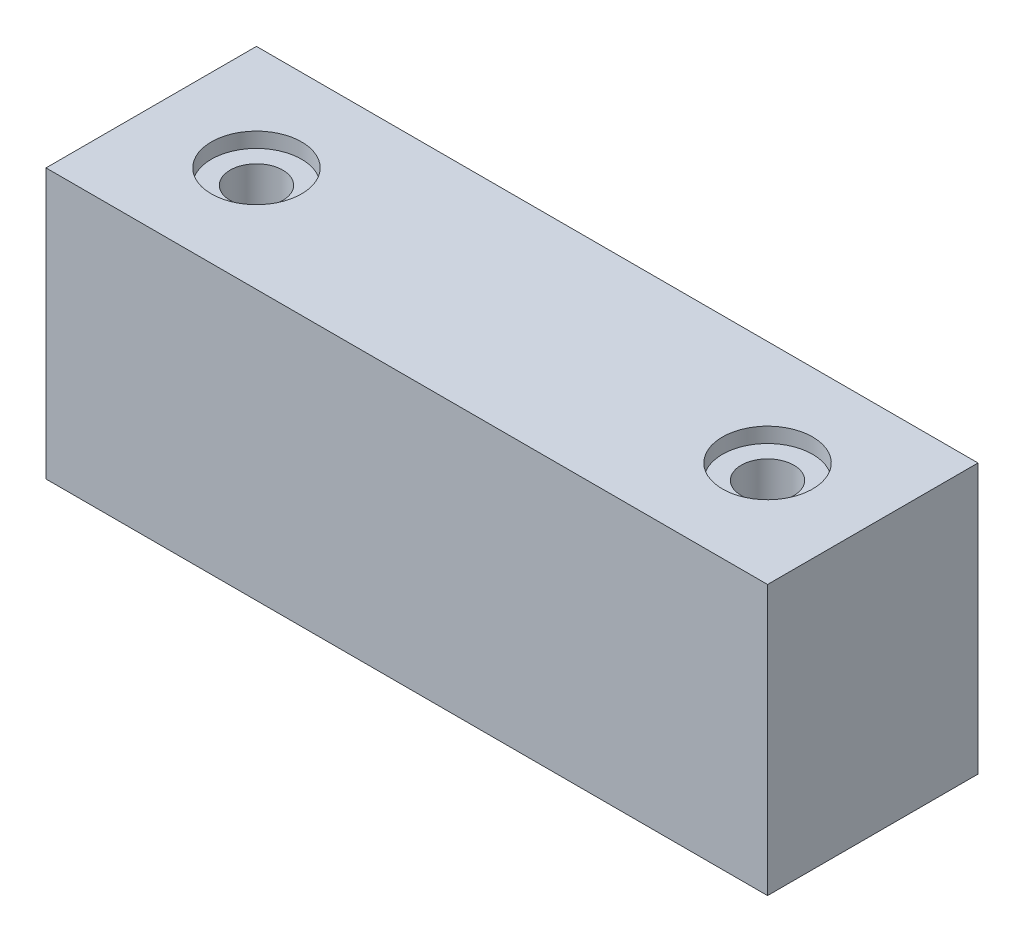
ISO-10303-21;
HEADER;
FILE_DESCRIPTION(('STEP AP214'),'2;1');
FILE_NAME('part.step','',(''),(''),'','','');
FILE_SCHEMA(('AUTOMOTIVE_DESIGN { 1 0 10303 214 1 1 1 1 }'));
ENDSEC;
DATA;
#1=APPLICATION_CONTEXT('core data for automotive mechanical design processes');
#2=APPLICATION_PROTOCOL_DEFINITION('international standard','automotive_design',2000,#1);
#3=PRODUCT_CONTEXT('',#1,'mechanical');
#4=PRODUCT('Part','Part','',(#3));
#5=PRODUCT_RELATED_PRODUCT_CATEGORY('part','',(#4));
#6=PRODUCT_DEFINITION_FORMATION('','',#4);
#7=PRODUCT_DEFINITION_CONTEXT('part definition',#1,'design');
#8=PRODUCT_DEFINITION('design','',#6,#7);
#9=PRODUCT_DEFINITION_SHAPE('','',#8);
#10=(LENGTH_UNIT() NAMED_UNIT(*) SI_UNIT(.MILLI.,.METRE.));
#11=(NAMED_UNIT(*) PLANE_ANGLE_UNIT() SI_UNIT($,.RADIAN.));
#12=(NAMED_UNIT(*) SI_UNIT($,.STERADIAN.) SOLID_ANGLE_UNIT());
#13=UNCERTAINTY_MEASURE_WITH_UNIT(LENGTH_MEASURE(1.E-05),#10,'distance_accuracy_value','');
#14=(GEOMETRIC_REPRESENTATION_CONTEXT(3) GLOBAL_UNCERTAINTY_ASSIGNED_CONTEXT((#13)) GLOBAL_UNIT_ASSIGNED_CONTEXT((#10,
#11,#12)) REPRESENTATION_CONTEXT('',''));
#15=CARTESIAN_POINT('',(0.,0.,0.));
#16=DIRECTION('',(0.,0.,1.));
#17=DIRECTION('',(1.,0.,0.));
#18=AXIS2_PLACEMENT_3D('',#15,#16,#17);
#19=CARTESIAN_POINT('',(-128.226206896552,-133.481379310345,88.9));
#20=DIRECTION('',(0.,1.,0.));
#21=DIRECTION('',(0.,0.,1.));
#22=AXIS2_PLACEMENT_3D('',#19,#20,#21);
#23=PLANE('',#22);
#24=CARTESIAN_POINT('',(-83.776206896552,-133.481379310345,44.45));
#25=DIRECTION('',(0.,1.,0.));
#26=DIRECTION('',(0.,0.,1.));
#27=AXIS2_PLACEMENT_3D('',#24,#25,#26);
#28=CIRCLE('',#27,11.1125);
#29=CARTESIAN_POINT('',(-83.776206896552,-133.481379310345,55.5625));
#30=VERTEX_POINT('',#29);
#31=EDGE_CURVE('E142',#30,#30,#28,.T.);
#32=ORIENTED_EDGE('',*,*,#31,.T.);
#33=EDGE_LOOP('',(#32));
#34=FACE_BOUND('',#33,.T.);
#35=CARTESIAN_POINT('',(132.123793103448,-133.481379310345,44.45));
#36=DIRECTION('',(0.,1.,0.));
#37=DIRECTION('',(0.,0.,-1.));
#38=AXIS2_PLACEMENT_3D('',#35,#36,#37);
#39=CIRCLE('',#38,11.1125);
#40=CARTESIAN_POINT('',(132.123793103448,-133.481379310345,55.5625));
#41=VERTEX_POINT('',#40);
#42=EDGE_CURVE('E145',#41,#41,#39,.T.);
#43=ORIENTED_EDGE('',*,*,#42,.T.);
#44=EDGE_LOOP('',(#43));
#45=FACE_BOUND('',#44,.T.);
#46=DIRECTION('',(1.,0.,0.));
#47=VECTOR('',#46,1.);
#48=CARTESIAN_POINT('',(-128.226206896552,-133.481379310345,0.));
#49=LINE('',#48,#47);
#50=CARTESIAN_POINT('',(-128.226206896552,-133.481379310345,0.));
#51=VERTEX_POINT('',#50);
#52=CARTESIAN_POINT('',(176.573793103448,-133.481379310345,0.));
#53=VERTEX_POINT('',#52);
#54=EDGE_CURVE('E105',#51,#53,#49,.T.);
#55=ORIENTED_EDGE('',*,*,#54,.T.);
#56=DIRECTION('',(0.,0.,-1.));
#57=VECTOR('',#56,1.);
#58=CARTESIAN_POINT('',(176.573793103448,-133.481379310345,88.9));
#59=LINE('',#58,#57);
#60=CARTESIAN_POINT('',(176.573793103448,-133.481379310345,88.9));
#61=VERTEX_POINT('',#60);
#62=EDGE_CURVE('E11',#61,#53,#59,.T.);
#63=ORIENTED_EDGE('',*,*,#62,.F.);
#64=DIRECTION('',(1.,0.,0.));
#65=VECTOR('',#64,1.);
#66=CARTESIAN_POINT('',(-128.226206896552,-133.481379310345,88.9));
#67=LINE('',#66,#65);
#68=CARTESIAN_POINT('',(-128.226206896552,-133.481379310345,88.9));
#69=VERTEX_POINT('',#68);
#70=EDGE_CURVE('E82',#69,#61,#67,.T.);
#71=ORIENTED_EDGE('',*,*,#70,.F.);
#72=DIRECTION('',(0.,0.,-1.));
#73=VECTOR('',#72,1.);
#74=CARTESIAN_POINT('',(-128.226206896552,-133.481379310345,88.9));
#75=LINE('',#74,#73);
#76=EDGE_CURVE('E101',#69,#51,#75,.T.);
#77=ORIENTED_EDGE('',*,*,#76,.T.);
#78=EDGE_LOOP('',(#55,#63,#71,#77));
#79=FACE_BOUND('',#78,.T.);
#80=ADVANCED_FACE('F43',(#34,#45,#79),#23,.F.);
#81=CARTESIAN_POINT('',(176.573793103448,-19.6504734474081,88.9));
#82=DIRECTION('',(1.,0.,0.));
#83=DIRECTION('',(0.,0.,-1.));
#84=AXIS2_PLACEMENT_3D('',#81,#82,#83);
#85=PLANE('',#84);
#86=DIRECTION('',(0.,-1.,0.));
#87=VECTOR('',#86,1.);
#88=CARTESIAN_POINT('',(176.573793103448,-19.6504734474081,0.));
#89=LINE('',#88,#87);
#90=CARTESIAN_POINT('',(176.573793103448,-19.6504734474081,0.));
#91=VERTEX_POINT('',#90);
#92=EDGE_CURVE('E91',#91,#53,#89,.T.);
#93=ORIENTED_EDGE('',*,*,#92,.F.);
#94=DIRECTION('',(0.,0.,-1.));
#95=VECTOR('',#94,1.);
#96=CARTESIAN_POINT('',(176.573793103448,-19.6504734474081,88.9));
#97=LINE('',#96,#95);
#98=CARTESIAN_POINT('',(176.573793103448,-19.6504734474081,88.9));
#99=VERTEX_POINT('',#98);
#100=EDGE_CURVE('E51',#99,#91,#97,.T.);
#101=ORIENTED_EDGE('',*,*,#100,.F.);
#102=DIRECTION('',(0.,-1.,0.));
#103=VECTOR('',#102,1.);
#104=CARTESIAN_POINT('',(176.573793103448,-19.6504734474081,88.9));
#105=LINE('',#104,#103);
#106=EDGE_CURVE('E89',#99,#61,#105,.T.);
#107=ORIENTED_EDGE('',*,*,#106,.T.);
#108=ORIENTED_EDGE('',*,*,#62,.T.);
#109=EDGE_LOOP('',(#93,#101,#107,#108));
#110=FACE_BOUND('',#109,.T.);
#111=ADVANCED_FACE('F88',(#110),#85,.T.);
#112=CARTESIAN_POINT('',(-128.226206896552,-19.6504734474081,88.9));
#113=DIRECTION('',(0.,1.,0.));
#114=DIRECTION('',(0.,0.,1.));
#115=AXIS2_PLACEMENT_3D('',#112,#113,#114);
#116=PLANE('',#115);
#117=CARTESIAN_POINT('',(-83.776206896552,-19.6504734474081,44.45));
#118=DIRECTION('',(0.,1.,0.));
#119=DIRECTION('',(0.,0.,1.));
#120=AXIS2_PLACEMENT_3D('',#117,#118,#119);
#121=CIRCLE('',#120,19.05);
#122=CARTESIAN_POINT('',(-83.776206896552,-19.6504734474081,63.5));
#123=VERTEX_POINT('',#122);
#124=EDGE_CURVE('E156',#123,#123,#121,.T.);
#125=ORIENTED_EDGE('',*,*,#124,.F.);
#126=EDGE_LOOP('',(#125));
#127=FACE_BOUND('',#126,.T.);
#128=CARTESIAN_POINT('',(132.123793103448,-19.6504734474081,44.45));
#129=DIRECTION('',(0.,1.,0.));
#130=DIRECTION('',(0.,0.,-1.));
#131=AXIS2_PLACEMENT_3D('',#128,#129,#130);
#132=CIRCLE('',#131,19.05);
#133=CARTESIAN_POINT('',(132.123793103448,-19.6504734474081,25.4));
#134=VERTEX_POINT('',#133);
#135=EDGE_CURVE('E159',#134,#134,#132,.T.);
#136=ORIENTED_EDGE('',*,*,#135,.F.);
#137=EDGE_LOOP('',(#136));
#138=FACE_BOUND('',#137,.T.);
#139=DIRECTION('',(1.,0.,0.));
#140=VECTOR('',#139,1.);
#141=CARTESIAN_POINT('',(-128.226206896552,-19.6504734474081,0.));
#142=LINE('',#141,#140);
#143=CARTESIAN_POINT('',(-128.226206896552,-19.6504734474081,0.));
#144=VERTEX_POINT('',#143);
#145=EDGE_CURVE('E110',#144,#91,#142,.T.);
#146=ORIENTED_EDGE('',*,*,#145,.F.);
#147=DIRECTION('',(0.,0.,-1.));
#148=VECTOR('',#147,1.);
#149=CARTESIAN_POINT('',(-128.226206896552,-19.6504734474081,88.9));
#150=LINE('',#149,#148);
#151=CARTESIAN_POINT('',(-128.226206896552,-19.6504734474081,88.9));
#152=VERTEX_POINT('',#151);
#153=EDGE_CURVE('E74',#152,#144,#150,.T.);
#154=ORIENTED_EDGE('',*,*,#153,.F.);
#155=DIRECTION('',(1.,0.,0.));
#156=VECTOR('',#155,1.);
#157=CARTESIAN_POINT('',(-128.226206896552,-19.6504734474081,88.9));
#158=LINE('',#157,#156);
#159=EDGE_CURVE('E97',#152,#99,#158,.T.);
#160=ORIENTED_EDGE('',*,*,#159,.T.);
#161=ORIENTED_EDGE('',*,*,#100,.T.);
#162=EDGE_LOOP('',(#146,#154,#160,#161));
#163=FACE_BOUND('',#162,.T.);
#164=ADVANCED_FACE('F99',(#127,#138,#163),#116,.T.);
#165=CARTESIAN_POINT('',(-128.226206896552,-19.6504734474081,88.9));
#166=DIRECTION('',(1.,0.,0.));
#167=DIRECTION('',(0.,1.,0.));
#168=AXIS2_PLACEMENT_3D('',#165,#166,#167);
#169=PLANE('',#168);
#170=DIRECTION('',(0.,-1.,0.));
#171=VECTOR('',#170,1.);
#172=CARTESIAN_POINT('',(-128.226206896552,-19.6504734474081,0.));
#173=LINE('',#172,#171);
#174=EDGE_CURVE('E77',#144,#51,#173,.T.);
#175=ORIENTED_EDGE('',*,*,#174,.T.);
#176=ORIENTED_EDGE('',*,*,#76,.F.);
#177=DIRECTION('',(0.,-1.,0.));
#178=VECTOR('',#177,1.);
#179=CARTESIAN_POINT('',(-128.226206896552,-19.6504734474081,88.9));
#180=LINE('',#179,#178);
#181=EDGE_CURVE('E59',#152,#69,#180,.T.);
#182=ORIENTED_EDGE('',*,*,#181,.F.);
#183=ORIENTED_EDGE('',*,*,#153,.T.);
#184=EDGE_LOOP('',(#175,#176,#182,#183));
#185=FACE_BOUND('',#184,.T.);
#186=ADVANCED_FACE('F129',(#185),#169,.F.);
#187=CARTESIAN_POINT('',(0.,0.,88.9));
#188=DIRECTION('',(0.,0.,-1.));
#189=DIRECTION('',(-1.,0.,0.));
#190=AXIS2_PLACEMENT_3D('',#187,#188,#189);
#191=PLANE('',#190);
#192=ORIENTED_EDGE('',*,*,#70,.T.);
#193=ORIENTED_EDGE('',*,*,#106,.F.);
#194=ORIENTED_EDGE('',*,*,#159,.F.);
#195=ORIENTED_EDGE('',*,*,#181,.T.);
#196=EDGE_LOOP('',(#192,#193,#194,#195));
#197=FACE_BOUND('',#196,.T.);
#198=ADVANCED_FACE('F96',(#197),#191,.F.);
#199=CARTESIAN_POINT('',(0.,0.,0.));
#200=DIRECTION('',(0.,0.,-1.));
#201=DIRECTION('',(-1.,0.,0.));
#202=AXIS2_PLACEMENT_3D('',#199,#200,#201);
#203=PLANE('',#202);
#204=ORIENTED_EDGE('',*,*,#54,.F.);
#205=ORIENTED_EDGE('',*,*,#174,.F.);
#206=ORIENTED_EDGE('',*,*,#145,.T.);
#207=ORIENTED_EDGE('',*,*,#92,.T.);
#208=EDGE_LOOP('',(#204,#205,#206,#207));
#209=FACE_BOUND('',#208,.T.);
#210=ADVANCED_FACE('F117',(#209),#203,.T.);
#211=CARTESIAN_POINT('',(132.123793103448,-26.0004734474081,44.45));
#212=DIRECTION('',(0.,1.,0.));
#213=DIRECTION('',(0.,0.,1.));
#214=AXIS2_PLACEMENT_3D('',#211,#212,#213);
#215=CYLINDRICAL_SURFACE('',#214,19.05);
#216=CARTESIAN_POINT('',(132.123793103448,-26.0004734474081,44.45));
#217=DIRECTION('',(0.,1.,0.));
#218=DIRECTION('',(0.,0.,-1.));
#219=AXIS2_PLACEMENT_3D('',#216,#217,#218);
#220=CIRCLE('',#219,19.05);
#221=CARTESIAN_POINT('',(132.123793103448,-26.0004734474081,25.4));
#222=VERTEX_POINT('',#221);
#223=EDGE_CURVE('E162',#222,#222,#220,.T.);
#224=ORIENTED_EDGE('',*,*,#223,.F.);
#225=EDGE_LOOP('',(#224));
#226=FACE_BOUND('',#225,.T.);
#227=ORIENTED_EDGE('',*,*,#135,.T.);
#228=EDGE_LOOP('',(#227));
#229=FACE_BOUND('',#228,.T.);
#230=ADVANCED_FACE('F119',(#226,#229),#215,.F.);
#231=CARTESIAN_POINT('',(132.123793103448,-26.0004734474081,44.45));
#232=DIRECTION('',(0.,-1.,0.));
#233=DIRECTION('',(0.,0.,-1.));
#234=AXIS2_PLACEMENT_3D('',#231,#232,#233);
#235=PLANE('',#234);
#236=CARTESIAN_POINT('',(132.123793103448,-26.0004734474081,44.45));
#237=DIRECTION('',(0.,1.,0.));
#238=DIRECTION('',(0.,0.,-1.));
#239=AXIS2_PLACEMENT_3D('',#236,#237,#238);
#240=CIRCLE('',#239,11.1125);
#241=CARTESIAN_POINT('',(132.123793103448,-26.0004734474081,55.5625));
#242=VERTEX_POINT('',#241);
#243=EDGE_CURVE('E147',#242,#242,#240,.T.);
#244=ORIENTED_EDGE('',*,*,#243,.F.);
#245=EDGE_LOOP('',(#244));
#246=FACE_BOUND('',#245,.T.);
#247=ORIENTED_EDGE('',*,*,#223,.T.);
#248=EDGE_LOOP('',(#247));
#249=FACE_BOUND('',#248,.T.);
#250=ADVANCED_FACE('F126',(#246,#249),#235,.F.);
#251=CARTESIAN_POINT('',(-83.776206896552,-26.0004734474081,44.45));
#252=DIRECTION('',(0.,1.,0.));
#253=DIRECTION('',(0.,0.,1.));
#254=AXIS2_PLACEMENT_3D('',#251,#252,#253);
#255=CYLINDRICAL_SURFACE('',#254,19.05);
#256=CARTESIAN_POINT('',(-83.776206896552,-26.0004734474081,44.45));
#257=DIRECTION('',(0.,1.,0.));
#258=DIRECTION('',(0.,0.,1.));
#259=AXIS2_PLACEMENT_3D('',#256,#257,#258);
#260=CIRCLE('',#259,19.05);
#261=CARTESIAN_POINT('',(-83.776206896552,-26.0004734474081,63.5));
#262=VERTEX_POINT('',#261);
#263=EDGE_CURVE('E108',#262,#262,#260,.T.);
#264=ORIENTED_EDGE('',*,*,#263,.F.);
#265=EDGE_LOOP('',(#264));
#266=FACE_BOUND('',#265,.T.);
#267=ORIENTED_EDGE('',*,*,#124,.T.);
#268=EDGE_LOOP('',(#267));
#269=FACE_BOUND('',#268,.T.);
#270=ADVANCED_FACE('F176',(#266,#269),#255,.F.);
#271=CARTESIAN_POINT('',(-83.776206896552,-26.0004734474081,44.45));
#272=DIRECTION('',(0.,1.,0.));
#273=DIRECTION('',(0.,0.,1.));
#274=AXIS2_PLACEMENT_3D('',#271,#272,#273);
#275=PLANE('',#274);
#276=CARTESIAN_POINT('',(-83.776206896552,-26.0004734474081,44.45));
#277=DIRECTION('',(0.,1.,0.));
#278=DIRECTION('',(0.,0.,1.));
#279=AXIS2_PLACEMENT_3D('',#276,#277,#278);
#280=CIRCLE('',#279,11.1125);
#281=CARTESIAN_POINT('',(-83.776206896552,-26.0004734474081,55.5625));
#282=VERTEX_POINT('',#281);
#283=EDGE_CURVE('E150',#282,#282,#280,.T.);
#284=ORIENTED_EDGE('',*,*,#283,.F.);
#285=EDGE_LOOP('',(#284));
#286=FACE_BOUND('',#285,.T.);
#287=ORIENTED_EDGE('',*,*,#263,.T.);
#288=EDGE_LOOP('',(#287));
#289=FACE_BOUND('',#288,.T.);
#290=ADVANCED_FACE('F172',(#286,#289),#275,.T.);
#291=CARTESIAN_POINT('',(132.123793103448,-133.481379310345,44.45));
#292=DIRECTION('',(0.,1.,0.));
#293=DIRECTION('',(0.,0.,1.));
#294=AXIS2_PLACEMENT_3D('',#291,#292,#293);
#295=CYLINDRICAL_SURFACE('',#294,11.1125);
#296=CARTESIAN_POINT('',(132.123793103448,-133.481379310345,55.5625));
#297=CARTESIAN_POINT('',(132.123793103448,-132.361786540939,55.5625));
#298=CARTESIAN_POINT('',(132.123793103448,-131.242193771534,55.5625));
#299=CARTESIAN_POINT('',(132.123793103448,-129.003008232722,55.5625));
#300=CARTESIAN_POINT('',(132.123793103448,-127.883415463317,55.5625));
#301=CARTESIAN_POINT('',(132.123793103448,-125.644229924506,55.5625));
#302=CARTESIAN_POINT('',(132.123793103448,-124.5246371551,55.5625));
#303=CARTESIAN_POINT('',(132.123793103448,-122.285451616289,55.5625));
#304=CARTESIAN_POINT('',(132.123793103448,-121.165858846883,55.5625));
#305=CARTESIAN_POINT('',(132.123793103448,-118.926673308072,55.5625));
#306=CARTESIAN_POINT('',(132.123793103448,-117.807080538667,55.5625));
#307=CARTESIAN_POINT('',(132.123793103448,-115.567894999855,55.5625));
#308=CARTESIAN_POINT('',(132.123793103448,-114.44830223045,55.5625));
#309=CARTESIAN_POINT('',(132.123793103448,-112.209116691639,55.5625));
#310=CARTESIAN_POINT('',(132.123793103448,-111.089523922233,55.5625));
#311=CARTESIAN_POINT('',(132.123793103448,-108.850338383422,55.5625));
#312=CARTESIAN_POINT('',(132.123793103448,-107.730745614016,55.5625));
#313=CARTESIAN_POINT('',(132.123793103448,-105.491560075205,55.5625));
#314=CARTESIAN_POINT('',(132.123793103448,-104.371967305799,55.5625));
#315=CARTESIAN_POINT('',(132.123793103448,-102.132781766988,55.5625));
#316=CARTESIAN_POINT('',(132.123793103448,-101.013188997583,55.5625));
#317=CARTESIAN_POINT('',(132.123793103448,-98.7740034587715,55.5625));
#318=CARTESIAN_POINT('',(132.123793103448,-97.6544106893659,55.5625));
#319=CARTESIAN_POINT('',(132.123793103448,-95.4152251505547,55.5625));
#320=CARTESIAN_POINT('',(132.123793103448,-94.2956323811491,55.5625));
#321=CARTESIAN_POINT('',(132.123793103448,-92.056446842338,55.5625));
#322=CARTESIAN_POINT('',(132.123793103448,-90.9368540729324,55.5625));
#323=CARTESIAN_POINT('',(132.123793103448,-88.6976685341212,55.5625));
#324=CARTESIAN_POINT('',(132.123793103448,-87.5780757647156,55.5625));
#325=CARTESIAN_POINT('',(132.123793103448,-85.3388902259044,55.5625));
#326=CARTESIAN_POINT('',(132.123793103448,-84.2192974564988,55.5625));
#327=CARTESIAN_POINT('',(132.123793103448,-81.9801119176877,55.5625));
#328=CARTESIAN_POINT('',(132.123793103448,-80.8605191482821,55.5625));
#329=CARTESIAN_POINT('',(132.123793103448,-78.6213336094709,55.5625));
#330=CARTESIAN_POINT('',(132.123793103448,-77.5017408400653,55.5625));
#331=CARTESIAN_POINT('',(132.123793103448,-75.2625553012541,55.5625));
#332=CARTESIAN_POINT('',(132.123793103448,-74.1429625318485,55.5625));
#333=CARTESIAN_POINT('',(132.123793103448,-71.9037769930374,55.5625));
#334=CARTESIAN_POINT('',(132.123793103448,-70.7841842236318,55.5625));
#335=CARTESIAN_POINT('',(132.123793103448,-68.5449986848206,55.5625));
#336=CARTESIAN_POINT('',(132.123793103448,-67.425405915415,55.5625));
#337=CARTESIAN_POINT('',(132.123793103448,-65.1862203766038,55.5625));
#338=CARTESIAN_POINT('',(132.123793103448,-64.0666276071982,55.5625));
#339=CARTESIAN_POINT('',(132.123793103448,-61.827442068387,55.5625));
#340=CARTESIAN_POINT('',(132.123793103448,-60.7078492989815,55.5625));
#341=CARTESIAN_POINT('',(132.123793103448,-58.4686637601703,55.5625));
#342=CARTESIAN_POINT('',(132.123793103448,-57.3490709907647,55.5625));
#343=CARTESIAN_POINT('',(132.123793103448,-55.1098854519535,55.5625));
#344=CARTESIAN_POINT('',(132.123793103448,-53.9902926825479,55.5625));
#345=CARTESIAN_POINT('',(132.123793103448,-51.7511071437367,55.5625));
#346=CARTESIAN_POINT('',(132.123793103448,-50.6315143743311,55.5625));
#347=CARTESIAN_POINT('',(132.123793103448,-48.3923288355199,55.5625));
#348=CARTESIAN_POINT('',(132.123793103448,-47.2727360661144,55.5625));
#349=CARTESIAN_POINT('',(132.123793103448,-45.0335505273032,55.5625));
#350=CARTESIAN_POINT('',(132.123793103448,-43.9139577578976,55.5625));
#351=CARTESIAN_POINT('',(132.123793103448,-41.6747722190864,55.5625));
#352=CARTESIAN_POINT('',(132.123793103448,-40.5551794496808,55.5625));
#353=CARTESIAN_POINT('',(132.123793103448,-38.3159939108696,55.5625));
#354=CARTESIAN_POINT('',(132.123793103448,-37.196401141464,55.5625));
#355=CARTESIAN_POINT('',(132.123793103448,-34.9572156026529,55.5625));
#356=CARTESIAN_POINT('',(132.123793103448,-33.8376228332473,55.5625));
#357=CARTESIAN_POINT('',(132.123793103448,-31.5984372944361,55.5625));
#358=CARTESIAN_POINT('',(132.123793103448,-30.4788445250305,55.5625));
#359=CARTESIAN_POINT('',(132.123793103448,-28.2396589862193,55.5625));
#360=CARTESIAN_POINT('',(132.123793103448,-27.1200662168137,55.5625));
#361=CARTESIAN_POINT('',(132.123793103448,-26.0004734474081,55.5625));
#362=B_SPLINE_CURVE_WITH_KNOTS('',3,(#296,#297,#298,#299,#300,#301,#302,#303,#304,#305,#306,
#307,#308,#309,#310,#311,#312,#313,#314,#315,#316,#317,#318,#319,#320,#321,#322,#323,#324,#325,
#326,#327,#328,#329,#330,#331,#332,#333,#334,#335,#336,#337,#338,#339,#340,#341,#342,#343,#344,
#345,#346,#347,#348,#349,#350,#351,#352,#353,#354,#355,#356,#357,#358,#359,#360,#361),
.UNSPECIFIED.,.F.,.F.,(4,2,2,2,2,2,2,2,2,2,2,2,2,2,2,2,2,2,2,2,2,2,2,2,2,2,2,2,2,2,2,2,4),(0.,
3.35877830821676,6.71755661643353,10.0763349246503,13.4351132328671,16.7938915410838,
20.1526698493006,23.5114481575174,26.8702264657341,30.2290047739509,33.5877830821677,
36.9465613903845,40.3053396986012,43.664118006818,47.0228963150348,50.3816746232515,
53.7404529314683,57.0992312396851,60.4580095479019,63.8167878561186,67.1755661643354,
70.5343444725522,73.8931227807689,77.2519010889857,80.6106793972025,83.9694577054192,
87.328236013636,90.6870143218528,94.0457926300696,97.4045709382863,100.763349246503,
104.12212755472,107.480905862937),.UNSPECIFIED.);
#363=EDGE_CURVE('BSEAM175',#41,#242,#362,.T.);
#364=ORIENTED_EDGE('',*,*,#42,.F.);
#365=ORIENTED_EDGE('',*,*,#243,.T.);
#366=ORIENTED_EDGE('',*,*,#363,.T.);
#367=ORIENTED_EDGE('',*,*,#363,.F.);
#368=EDGE_LOOP('',(#364,#366,#365,#367));
#369=FACE_BOUND('',#368,.T.);
#370=ADVANCED_FACE('F175',(#369),#295,.F.);
#371=CARTESIAN_POINT('',(-83.776206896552,-133.481379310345,44.45));
#372=DIRECTION('',(0.,1.,0.));
#373=DIRECTION('',(0.,0.,1.));
#374=AXIS2_PLACEMENT_3D('',#371,#372,#373);
#375=CYLINDRICAL_SURFACE('',#374,11.1125);
#376=CARTESIAN_POINT('',(-83.776206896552,-133.481379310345,55.5625));
#377=CARTESIAN_POINT('',(-83.776206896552,-132.361786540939,55.5625));
#378=CARTESIAN_POINT('',(-83.776206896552,-131.242193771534,55.5625));
#379=CARTESIAN_POINT('',(-83.776206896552,-129.003008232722,55.5625));
#380=CARTESIAN_POINT('',(-83.776206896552,-127.883415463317,55.5625));
#381=CARTESIAN_POINT('',(-83.776206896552,-125.644229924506,55.5625));
#382=CARTESIAN_POINT('',(-83.776206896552,-124.5246371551,55.5625));
#383=CARTESIAN_POINT('',(-83.776206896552,-122.285451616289,55.5625));
#384=CARTESIAN_POINT('',(-83.776206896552,-121.165858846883,55.5625));
#385=CARTESIAN_POINT('',(-83.776206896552,-118.926673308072,55.5625));
#386=CARTESIAN_POINT('',(-83.776206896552,-117.807080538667,55.5625));
#387=CARTESIAN_POINT('',(-83.776206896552,-115.567894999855,55.5625));
#388=CARTESIAN_POINT('',(-83.776206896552,-114.44830223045,55.5625));
#389=CARTESIAN_POINT('',(-83.776206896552,-112.209116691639,55.5625));
#390=CARTESIAN_POINT('',(-83.776206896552,-111.089523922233,55.5625));
#391=CARTESIAN_POINT('',(-83.776206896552,-108.850338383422,55.5625));
#392=CARTESIAN_POINT('',(-83.776206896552,-107.730745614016,55.5625));
#393=CARTESIAN_POINT('',(-83.776206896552,-105.491560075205,55.5625));
#394=CARTESIAN_POINT('',(-83.776206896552,-104.371967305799,55.5625));
#395=CARTESIAN_POINT('',(-83.776206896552,-102.132781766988,55.5625));
#396=CARTESIAN_POINT('',(-83.776206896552,-101.013188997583,55.5625));
#397=CARTESIAN_POINT('',(-83.776206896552,-98.7740034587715,55.5625));
#398=CARTESIAN_POINT('',(-83.776206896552,-97.6544106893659,55.5625));
#399=CARTESIAN_POINT('',(-83.776206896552,-95.4152251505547,55.5625));
#400=CARTESIAN_POINT('',(-83.776206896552,-94.2956323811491,55.5625));
#401=CARTESIAN_POINT('',(-83.776206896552,-92.056446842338,55.5625));
#402=CARTESIAN_POINT('',(-83.776206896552,-90.9368540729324,55.5625));
#403=CARTESIAN_POINT('',(-83.776206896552,-88.6976685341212,55.5625));
#404=CARTESIAN_POINT('',(-83.776206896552,-87.5780757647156,55.5625));
#405=CARTESIAN_POINT('',(-83.776206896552,-85.3388902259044,55.5625));
#406=CARTESIAN_POINT('',(-83.776206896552,-84.2192974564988,55.5625));
#407=CARTESIAN_POINT('',(-83.776206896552,-81.9801119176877,55.5625));
#408=CARTESIAN_POINT('',(-83.776206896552,-80.8605191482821,55.5625));
#409=CARTESIAN_POINT('',(-83.776206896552,-78.6213336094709,55.5625));
#410=CARTESIAN_POINT('',(-83.776206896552,-77.5017408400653,55.5625));
#411=CARTESIAN_POINT('',(-83.776206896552,-75.2625553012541,55.5625));
#412=CARTESIAN_POINT('',(-83.776206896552,-74.1429625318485,55.5625));
#413=CARTESIAN_POINT('',(-83.776206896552,-71.9037769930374,55.5625));
#414=CARTESIAN_POINT('',(-83.776206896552,-70.7841842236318,55.5625));
#415=CARTESIAN_POINT('',(-83.776206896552,-68.5449986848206,55.5625));
#416=CARTESIAN_POINT('',(-83.776206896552,-67.425405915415,55.5625));
#417=CARTESIAN_POINT('',(-83.776206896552,-65.1862203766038,55.5625));
#418=CARTESIAN_POINT('',(-83.776206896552,-64.0666276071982,55.5625));
#419=CARTESIAN_POINT('',(-83.776206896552,-61.827442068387,55.5625));
#420=CARTESIAN_POINT('',(-83.776206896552,-60.7078492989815,55.5625));
#421=CARTESIAN_POINT('',(-83.776206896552,-58.4686637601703,55.5625));
#422=CARTESIAN_POINT('',(-83.776206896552,-57.3490709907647,55.5625));
#423=CARTESIAN_POINT('',(-83.776206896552,-55.1098854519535,55.5625));
#424=CARTESIAN_POINT('',(-83.776206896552,-53.9902926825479,55.5625));
#425=CARTESIAN_POINT('',(-83.776206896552,-51.7511071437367,55.5625));
#426=CARTESIAN_POINT('',(-83.776206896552,-50.6315143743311,55.5625));
#427=CARTESIAN_POINT('',(-83.776206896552,-48.3923288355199,55.5625));
#428=CARTESIAN_POINT('',(-83.776206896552,-47.2727360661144,55.5625));
#429=CARTESIAN_POINT('',(-83.776206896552,-45.0335505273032,55.5625));
#430=CARTESIAN_POINT('',(-83.776206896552,-43.9139577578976,55.5625));
#431=CARTESIAN_POINT('',(-83.776206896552,-41.6747722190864,55.5625));
#432=CARTESIAN_POINT('',(-83.776206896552,-40.5551794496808,55.5625));
#433=CARTESIAN_POINT('',(-83.776206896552,-38.3159939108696,55.5625));
#434=CARTESIAN_POINT('',(-83.776206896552,-37.196401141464,55.5625));
#435=CARTESIAN_POINT('',(-83.776206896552,-34.9572156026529,55.5625));
#436=CARTESIAN_POINT('',(-83.776206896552,-33.8376228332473,55.5625));
#437=CARTESIAN_POINT('',(-83.776206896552,-31.5984372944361,55.5625));
#438=CARTESIAN_POINT('',(-83.776206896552,-30.4788445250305,55.5625));
#439=CARTESIAN_POINT('',(-83.776206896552,-28.2396589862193,55.5625));
#440=CARTESIAN_POINT('',(-83.776206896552,-27.1200662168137,55.5625));
#441=CARTESIAN_POINT('',(-83.776206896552,-26.0004734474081,55.5625));
#442=B_SPLINE_CURVE_WITH_KNOTS('',3,(#376,#377,#378,#379,#380,#381,#382,#383,#384,#385,#386,
#387,#388,#389,#390,#391,#392,#393,#394,#395,#396,#397,#398,#399,#400,#401,#402,#403,#404,#405,
#406,#407,#408,#409,#410,#411,#412,#413,#414,#415,#416,#417,#418,#419,#420,#421,#422,#423,#424,
#425,#426,#427,#428,#429,#430,#431,#432,#433,#434,#435,#436,#437,#438,#439,#440,#441),
.UNSPECIFIED.,.F.,.F.,(4,2,2,2,2,2,2,2,2,2,2,2,2,2,2,2,2,2,2,2,2,2,2,2,2,2,2,2,2,2,2,2,4),(0.,
3.35877830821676,6.71755661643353,10.0763349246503,13.4351132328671,16.7938915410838,
20.1526698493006,23.5114481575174,26.8702264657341,30.2290047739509,33.5877830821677,
36.9465613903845,40.3053396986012,43.664118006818,47.0228963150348,50.3816746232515,
53.7404529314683,57.0992312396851,60.4580095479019,63.8167878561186,67.1755661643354,
70.5343444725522,73.8931227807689,77.2519010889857,80.6106793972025,83.9694577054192,
87.328236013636,90.6870143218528,94.0457926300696,97.4045709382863,100.763349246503,
104.12212755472,107.480905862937),.UNSPECIFIED.);
#443=EDGE_CURVE('BSEAM170',#30,#282,#442,.T.);
#444=ORIENTED_EDGE('',*,*,#31,.F.);
#445=ORIENTED_EDGE('',*,*,#283,.T.);
#446=ORIENTED_EDGE('',*,*,#443,.T.);
#447=ORIENTED_EDGE('',*,*,#443,.F.);
#448=EDGE_LOOP('',(#444,#446,#445,#447));
#449=FACE_BOUND('',#448,.T.);
#450=ADVANCED_FACE('F170',(#449),#375,.F.);
#451=CLOSED_SHELL('',(#80,#111,#164,#186,#198,#210,#230,#250,#270,#290,#370,#450));
#452=MANIFOLD_SOLID_BREP('B2',#451);
#453=ADVANCED_BREP_SHAPE_REPRESENTATION('',(#18,#452),#14);
#454=SHAPE_DEFINITION_REPRESENTATION(#9,#453);
ENDSEC;
END-ISO-10303-21;
